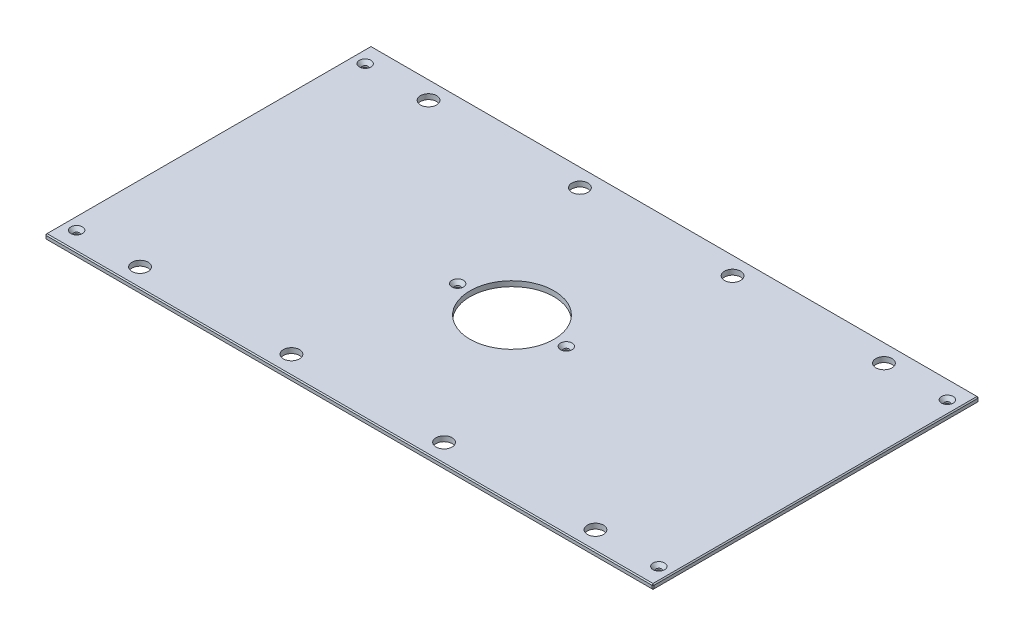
ISO-10303-21;
HEADER;
FILE_DESCRIPTION(('STEP AP214'),'2;1');
FILE_NAME('part.step','',(''),(''),'','','');
FILE_SCHEMA(('AUTOMOTIVE_DESIGN { 1 0 10303 214 1 1 1 1 }'));
ENDSEC;
DATA;
#1=APPLICATION_CONTEXT('core data for automotive mechanical design processes');
#2=APPLICATION_PROTOCOL_DEFINITION('international standard','automotive_design',2000,#1);
#3=PRODUCT_CONTEXT('',#1,'mechanical');
#4=PRODUCT('Part','Part','',(#3));
#5=PRODUCT_RELATED_PRODUCT_CATEGORY('part','',(#4));
#6=PRODUCT_DEFINITION_FORMATION('','',#4);
#7=PRODUCT_DEFINITION_CONTEXT('part definition',#1,'design');
#8=PRODUCT_DEFINITION('design','',#6,#7);
#9=PRODUCT_DEFINITION_SHAPE('','',#8);
#10=(LENGTH_UNIT() NAMED_UNIT(*) SI_UNIT(.MILLI.,.METRE.));
#11=(NAMED_UNIT(*) PLANE_ANGLE_UNIT() SI_UNIT($,.RADIAN.));
#12=(NAMED_UNIT(*) SI_UNIT($,.STERADIAN.) SOLID_ANGLE_UNIT());
#13=UNCERTAINTY_MEASURE_WITH_UNIT(LENGTH_MEASURE(1.E-05),#10,'distance_accuracy_value','');
#14=(GEOMETRIC_REPRESENTATION_CONTEXT(3) GLOBAL_UNCERTAINTY_ASSIGNED_CONTEXT((#13)) GLOBAL_UNIT_ASSIGNED_CONTEXT((#10,
#11,#12)) REPRESENTATION_CONTEXT('',''));
#15=CARTESIAN_POINT('',(0.,0.,0.));
#16=DIRECTION('',(0.,0.,1.));
#17=DIRECTION('',(1.,0.,0.));
#18=AXIS2_PLACEMENT_3D('',#15,#16,#17);
#19=CARTESIAN_POINT('',(-373.0625,6.35,-200.025));
#20=DIRECTION('',(1.,0.,0.));
#21=DIRECTION('',(0.,0.,-1.));
#22=AXIS2_PLACEMENT_3D('',#19,#20,#21);
#23=PLANE('',#22);
#24=DIRECTION('',(0.,0.,-1.));
#25=VECTOR('',#24,1.);
#26=CARTESIAN_POINT('',(-373.0625,5.0799999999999,-200.025));
#27=LINE('',#26,#25);
#28=CARTESIAN_POINT('',(-373.0625,5.0799999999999,198.755));
#29=VERTEX_POINT('',#28);
#30=CARTESIAN_POINT('',(-373.0625,5.0799999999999,-198.755));
#31=VERTEX_POINT('',#30);
#32=EDGE_CURVE('E140',#29,#31,#27,.T.);
#33=ORIENTED_EDGE('',*,*,#32,.T.);
#34=DIRECTION('',(0.,-1.,0.));
#35=VECTOR('',#34,1.);
#36=CARTESIAN_POINT('',(-373.0625,6.35,-198.755));
#37=LINE('',#36,#35);
#38=CARTESIAN_POINT('',(-373.0625,1.2700000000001,-198.755));
#39=VERTEX_POINT('',#38);
#40=EDGE_CURVE('E135',#31,#39,#37,.T.);
#41=ORIENTED_EDGE('',*,*,#40,.T.);
#42=DIRECTION('',(0.,0.,1.));
#43=VECTOR('',#42,1.);
#44=CARTESIAN_POINT('',(-373.0625,1.2700000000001,-200.025));
#45=LINE('',#44,#43);
#46=CARTESIAN_POINT('',(-373.0625,1.2700000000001,198.755));
#47=VERTEX_POINT('',#46);
#48=EDGE_CURVE('E130',#39,#47,#45,.T.);
#49=ORIENTED_EDGE('',*,*,#48,.T.);
#50=DIRECTION('',(0.,1.,0.));
#51=VECTOR('',#50,1.);
#52=CARTESIAN_POINT('',(-373.0625,6.35,198.755));
#53=LINE('',#52,#51);
#54=EDGE_CURVE('E132',#47,#29,#53,.T.);
#55=ORIENTED_EDGE('',*,*,#54,.T.);
#56=EDGE_LOOP('',(#33,#41,#49,#55));
#57=FACE_BOUND('',#56,.T.);
#58=ADVANCED_FACE('F38',(#57),#23,.F.);
#59=CARTESIAN_POINT('',(-373.0625,6.35,200.025));
#60=DIRECTION('',(0.,0.,-1.));
#61=DIRECTION('',(-1.,0.,0.));
#62=AXIS2_PLACEMENT_3D('',#59,#60,#61);
#63=PLANE('',#62);
#64=DIRECTION('',(1.,0.,0.));
#65=VECTOR('',#64,1.);
#66=CARTESIAN_POINT('',(-373.0625,1.26999999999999,200.025));
#67=LINE('',#66,#65);
#68=CARTESIAN_POINT('',(-371.7925,1.26999999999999,200.025));
#69=VERTEX_POINT('',#68);
#70=CARTESIAN_POINT('',(371.7925,1.26999999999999,200.025));
#71=VERTEX_POINT('',#70);
#72=EDGE_CURVE('E62',#69,#71,#67,.T.);
#73=ORIENTED_EDGE('',*,*,#72,.T.);
#74=DIRECTION('',(0.,1.,0.));
#75=VECTOR('',#74,1.);
#76=CARTESIAN_POINT('',(371.7925,6.35,200.025));
#77=LINE('',#76,#75);
#78=CARTESIAN_POINT('',(371.7925,5.08000000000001,200.025));
#79=VERTEX_POINT('',#78);
#80=EDGE_CURVE('E11',#71,#79,#77,.T.);
#81=ORIENTED_EDGE('',*,*,#80,.T.);
#82=DIRECTION('',(-1.,0.,0.));
#83=VECTOR('',#82,1.);
#84=CARTESIAN_POINT('',(-373.0625,5.08000000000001,200.025));
#85=LINE('',#84,#83);
#86=CARTESIAN_POINT('',(-371.7925,5.08000000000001,200.025));
#87=VERTEX_POINT('',#86);
#88=EDGE_CURVE('E48',#79,#87,#85,.T.);
#89=ORIENTED_EDGE('',*,*,#88,.T.);
#90=DIRECTION('',(0.,-1.,0.));
#91=VECTOR('',#90,1.);
#92=CARTESIAN_POINT('',(-371.7925,6.35,200.025));
#93=LINE('',#92,#91);
#94=EDGE_CURVE('E367',#87,#69,#93,.T.);
#95=ORIENTED_EDGE('',*,*,#94,.T.);
#96=EDGE_LOOP('',(#73,#81,#89,#95));
#97=FACE_BOUND('',#96,.T.);
#98=ADVANCED_FACE('F446',(#97),#63,.F.);
#99=CARTESIAN_POINT('',(373.0625,6.35,-200.025));
#100=DIRECTION('',(-1.,0.,0.));
#101=DIRECTION('',(0.,0.,1.));
#102=AXIS2_PLACEMENT_3D('',#99,#100,#101);
#103=PLANE('',#102);
#104=DIRECTION('',(0.,0.,-1.));
#105=VECTOR('',#104,1.);
#106=CARTESIAN_POINT('',(373.0625,1.26999999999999,-200.025));
#107=LINE('',#106,#105);
#108=CARTESIAN_POINT('',(373.0625,1.26999999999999,198.755));
#109=VERTEX_POINT('',#108);
#110=CARTESIAN_POINT('',(373.0625,1.26999999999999,-198.755));
#111=VERTEX_POINT('',#110);
#112=EDGE_CURVE('E360',#109,#111,#107,.T.);
#113=ORIENTED_EDGE('',*,*,#112,.T.);
#114=DIRECTION('',(0.,1.,0.));
#115=VECTOR('',#114,1.);
#116=CARTESIAN_POINT('',(373.0625,6.35,-198.755));
#117=LINE('',#116,#115);
#118=CARTESIAN_POINT('',(373.0625,5.0799999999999,-198.755));
#119=VERTEX_POINT('',#118);
#120=EDGE_CURVE('E363',#111,#119,#117,.T.);
#121=ORIENTED_EDGE('',*,*,#120,.T.);
#122=DIRECTION('',(0.,0.,1.));
#123=VECTOR('',#122,1.);
#124=CARTESIAN_POINT('',(373.0625,5.0799999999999,200.025));
#125=LINE('',#124,#123);
#126=CARTESIAN_POINT('',(373.0625,5.0799999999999,198.755));
#127=VERTEX_POINT('',#126);
#128=EDGE_CURVE('E357',#119,#127,#125,.T.);
#129=ORIENTED_EDGE('',*,*,#128,.T.);
#130=DIRECTION('',(0.,-1.,0.));
#131=VECTOR('',#130,1.);
#132=CARTESIAN_POINT('',(373.0625,6.35,198.755));
#133=LINE('',#132,#131);
#134=EDGE_CURVE('E354',#127,#109,#133,.T.);
#135=ORIENTED_EDGE('',*,*,#134,.T.);
#136=EDGE_LOOP('',(#113,#121,#129,#135));
#137=FACE_BOUND('',#136,.T.);
#138=ADVANCED_FACE('F433',(#137),#103,.F.);
#139=CARTESIAN_POINT('',(-373.0625,6.35,-200.025));
#140=DIRECTION('',(0.,0.,1.));
#141=DIRECTION('',(1.,0.,0.));
#142=AXIS2_PLACEMENT_3D('',#139,#140,#141);
#143=PLANE('',#142);
#144=DIRECTION('',(-1.,0.,0.));
#145=VECTOR('',#144,1.);
#146=CARTESIAN_POINT('',(-373.0625,1.26999999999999,-200.025));
#147=LINE('',#146,#145);
#148=CARTESIAN_POINT('',(371.7925,1.26999999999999,-200.025));
#149=VERTEX_POINT('',#148);
#150=CARTESIAN_POINT('',(-371.7925,1.26999999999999,-200.025));
#151=VERTEX_POINT('',#150);
#152=EDGE_CURVE('E319',#149,#151,#147,.T.);
#153=ORIENTED_EDGE('',*,*,#152,.T.);
#154=DIRECTION('',(0.,1.,0.));
#155=VECTOR('',#154,1.);
#156=CARTESIAN_POINT('',(-371.7925,6.35,-200.025));
#157=LINE('',#156,#155);
#158=CARTESIAN_POINT('',(-371.7925,5.0799999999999,-200.025));
#159=VERTEX_POINT('',#158);
#160=EDGE_CURVE('E325',#151,#159,#157,.T.);
#161=ORIENTED_EDGE('',*,*,#160,.T.);
#162=DIRECTION('',(1.,0.,0.));
#163=VECTOR('',#162,1.);
#164=CARTESIAN_POINT('',(373.0625,5.0799999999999,-200.025));
#165=LINE('',#164,#163);
#166=CARTESIAN_POINT('',(371.7925,5.0799999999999,-200.025));
#167=VERTEX_POINT('',#166);
#168=EDGE_CURVE('E322',#159,#167,#165,.T.);
#169=ORIENTED_EDGE('',*,*,#168,.T.);
#170=DIRECTION('',(0.,-1.,0.));
#171=VECTOR('',#170,1.);
#172=CARTESIAN_POINT('',(371.7925,6.35,-200.025));
#173=LINE('',#172,#171);
#174=EDGE_CURVE('E316',#167,#149,#173,.T.);
#175=ORIENTED_EDGE('',*,*,#174,.T.);
#176=EDGE_LOOP('',(#153,#161,#169,#175));
#177=FACE_BOUND('',#176,.T.);
#178=ADVANCED_FACE('F407',(#177),#143,.F.);
#179=CARTESIAN_POINT('',(0.,6.35,0.));
#180=DIRECTION('',(0.,1.,0.));
#181=DIRECTION('',(0.,0.,1.));
#182=AXIS2_PLACEMENT_3D('',#179,#180,#181);
#183=PLANE('',#182);
#184=CARTESIAN_POINT('',(357.1875,6.35,-177.00498));
#185=DIRECTION('',(0.,1.,0.));
#186=DIRECTION('',(0.,0.,1.));
#187=AXIS2_PLACEMENT_3D('',#184,#185,#186);
#188=CIRCLE('',#187,7.13740000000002);
#189=CARTESIAN_POINT('',(357.1875,6.35,-169.86758));
#190=VERTEX_POINT('',#189);
#191=EDGE_CURVE('E978',#190,#190,#188,.T.);
#192=ORIENTED_EDGE('',*,*,#191,.F.);
#193=EDGE_LOOP('',(#192));
#194=FACE_BOUND('',#193,.T.);
#195=CARTESIAN_POINT('',(357.1875,6.35,177.00498));
#196=DIRECTION('',(0.,1.,0.));
#197=DIRECTION('',(0.,0.,1.));
#198=AXIS2_PLACEMENT_3D('',#195,#196,#197);
#199=CIRCLE('',#198,7.13740000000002);
#200=CARTESIAN_POINT('',(357.1875,6.35,184.14238));
#201=VERTEX_POINT('',#200);
#202=EDGE_CURVE('E982',#201,#201,#199,.T.);
#203=ORIENTED_EDGE('',*,*,#202,.F.);
#204=EDGE_LOOP('',(#203));
#205=FACE_BOUND('',#204,.T.);
#206=CARTESIAN_POINT('',(-357.1875,6.35,177.00498));
#207=DIRECTION('',(0.,1.,0.));
#208=DIRECTION('',(0.,0.,1.));
#209=AXIS2_PLACEMENT_3D('',#206,#207,#208);
#210=CIRCLE('',#209,7.13740000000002);
#211=CARTESIAN_POINT('',(-357.1875,6.35,184.14238));
#212=VERTEX_POINT('',#211);
#213=EDGE_CURVE('E986',#212,#212,#210,.T.);
#214=ORIENTED_EDGE('',*,*,#213,.F.);
#215=EDGE_LOOP('',(#214));
#216=FACE_BOUND('',#215,.T.);
#217=CARTESIAN_POINT('',(-66.675,6.35,0.));
#218=DIRECTION('',(0.,1.,0.));
#219=DIRECTION('',(0.,0.,1.));
#220=AXIS2_PLACEMENT_3D('',#217,#218,#219);
#221=CIRCLE('',#220,7.1374);
#222=CARTESIAN_POINT('',(-66.675,6.35,7.1374));
#223=VERTEX_POINT('',#222);
#224=EDGE_CURVE('E990',#223,#223,#221,.T.);
#225=ORIENTED_EDGE('',*,*,#224,.F.);
#226=EDGE_LOOP('',(#225));
#227=FACE_BOUND('',#226,.T.);
#228=CARTESIAN_POINT('',(66.675,6.35,0.));
#229=DIRECTION('',(0.,1.,0.));
#230=DIRECTION('',(0.,0.,1.));
#231=AXIS2_PLACEMENT_3D('',#228,#229,#230);
#232=CIRCLE('',#231,7.1374);
#233=CARTESIAN_POINT('',(66.675,6.35,7.1374));
#234=VERTEX_POINT('',#233);
#235=EDGE_CURVE('E994',#234,#234,#232,.T.);
#236=ORIENTED_EDGE('',*,*,#235,.F.);
#237=EDGE_LOOP('',(#236));
#238=FACE_BOUND('',#237,.T.);
#239=CARTESIAN_POINT('',(-357.1875,6.35,-177.00498));
#240=DIRECTION('',(0.,1.,0.));
#241=DIRECTION('',(0.,0.,1.));
#242=AXIS2_PLACEMENT_3D('',#239,#240,#241);
#243=CIRCLE('',#242,7.13740000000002);
#244=CARTESIAN_POINT('',(-357.1875,6.35,-169.86758));
#245=VERTEX_POINT('',#244);
#246=EDGE_CURVE('E997',#245,#245,#243,.T.);
#247=ORIENTED_EDGE('',*,*,#246,.F.);
#248=EDGE_LOOP('',(#247));
#249=FACE_BOUND('',#248,.T.);
#250=DIRECTION('',(0.,0.,-1.));
#251=VECTOR('',#250,1.);
#252=CARTESIAN_POINT('',(371.7925,6.35,-200.025));
#253=LINE('',#252,#251);
#254=CARTESIAN_POINT('',(371.7925,6.35,198.755));
#255=VERTEX_POINT('',#254);
#256=CARTESIAN_POINT('',(371.7925,6.35,-198.755));
#257=VERTEX_POINT('',#256);
#258=EDGE_CURVE('E335',#255,#257,#253,.T.);
#259=ORIENTED_EDGE('',*,*,#258,.T.);
#260=DIRECTION('',(-1.,0.,0.));
#261=VECTOR('',#260,1.);
#262=CARTESIAN_POINT('',(-373.0625,6.35,-198.755));
#263=LINE('',#262,#261);
#264=CARTESIAN_POINT('',(-371.7925,6.35,-198.755));
#265=VERTEX_POINT('',#264);
#266=EDGE_CURVE('E338',#257,#265,#263,.T.);
#267=ORIENTED_EDGE('',*,*,#266,.T.);
#268=DIRECTION('',(0.,0.,1.));
#269=VECTOR('',#268,1.);
#270=CARTESIAN_POINT('',(-371.7925,6.35,200.025));
#271=LINE('',#270,#269);
#272=CARTESIAN_POINT('',(-371.7925,6.35,198.755));
#273=VERTEX_POINT('',#272);
#274=EDGE_CURVE('E332',#265,#273,#271,.T.);
#275=ORIENTED_EDGE('',*,*,#274,.T.);
#276=DIRECTION('',(1.,0.,0.));
#277=VECTOR('',#276,1.);
#278=CARTESIAN_POINT('',(373.0625,6.35,198.755));
#279=LINE('',#278,#277);
#280=EDGE_CURVE('E329',#273,#255,#279,.T.);
#281=ORIENTED_EDGE('',*,*,#280,.T.);
#282=EDGE_LOOP('',(#259,#267,#275,#281));
#283=FACE_BOUND('',#282,.T.);
#284=CARTESIAN_POINT('',(279.4,6.35,-177.00498));
#285=DIRECTION('',(0.,1.,0.));
#286=DIRECTION('',(0.,0.,1.));
#287=AXIS2_PLACEMENT_3D('',#284,#285,#286);
#288=CIRCLE('',#287,9.92187500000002);
#289=CARTESIAN_POINT('',(279.4,6.35,-167.083105));
#290=VERTEX_POINT('',#289);
#291=EDGE_CURVE('E231',#290,#290,#288,.T.);
#292=ORIENTED_EDGE('',*,*,#291,.F.);
#293=EDGE_LOOP('',(#292));
#294=FACE_BOUND('',#293,.T.);
#295=CARTESIAN_POINT('',(-279.4,6.35,-177.00498));
#296=DIRECTION('',(0.,1.,0.));
#297=DIRECTION('',(0.,0.,1.));
#298=AXIS2_PLACEMENT_3D('',#295,#296,#297);
#299=CIRCLE('',#298,9.92187500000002);
#300=CARTESIAN_POINT('',(-279.4,6.35,-167.083105));
#301=VERTEX_POINT('',#300);
#302=EDGE_CURVE('E246',#301,#301,#299,.T.);
#303=ORIENTED_EDGE('',*,*,#302,.F.);
#304=EDGE_LOOP('',(#303));
#305=FACE_BOUND('',#304,.T.);
#306=CARTESIAN_POINT('',(279.4,6.35,177.00498));
#307=DIRECTION('',(0.,1.,0.));
#308=DIRECTION('',(0.,0.,1.));
#309=AXIS2_PLACEMENT_3D('',#306,#307,#308);
#310=CIRCLE('',#309,9.92187500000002);
#311=CARTESIAN_POINT('',(279.4,6.35,186.926855));
#312=VERTEX_POINT('',#311);
#313=EDGE_CURVE('E259',#312,#312,#310,.T.);
#314=ORIENTED_EDGE('',*,*,#313,.F.);
#315=EDGE_LOOP('',(#314));
#316=FACE_BOUND('',#315,.T.);
#317=CARTESIAN_POINT('',(-279.4,6.35,177.00498));
#318=DIRECTION('',(0.,1.,0.));
#319=DIRECTION('',(0.,0.,1.));
#320=AXIS2_PLACEMENT_3D('',#317,#318,#319);
#321=CIRCLE('',#320,9.92187500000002);
#322=CARTESIAN_POINT('',(-279.4,6.35,186.926855));
#323=VERTEX_POINT('',#322);
#324=EDGE_CURVE('E267',#323,#323,#321,.T.);
#325=ORIENTED_EDGE('',*,*,#324,.F.);
#326=EDGE_LOOP('',(#325));
#327=FACE_BOUND('',#326,.T.);
#328=CARTESIAN_POINT('',(-93.6625,6.35,-177.00498));
#329=DIRECTION('',(0.,1.,0.));
#330=DIRECTION('',(0.,0.,1.));
#331=AXIS2_PLACEMENT_3D('',#328,#329,#330);
#332=CIRCLE('',#331,9.921875);
#333=CARTESIAN_POINT('',(-93.6625,6.35,-167.083105));
#334=VERTEX_POINT('',#333);
#335=EDGE_CURVE('E274',#334,#334,#332,.T.);
#336=ORIENTED_EDGE('',*,*,#335,.F.);
#337=EDGE_LOOP('',(#336));
#338=FACE_BOUND('',#337,.T.);
#339=CARTESIAN_POINT('',(93.6625,6.35,-177.00498));
#340=DIRECTION('',(0.,1.,0.));
#341=DIRECTION('',(0.,0.,1.));
#342=AXIS2_PLACEMENT_3D('',#339,#340,#341);
#343=CIRCLE('',#342,9.921875);
#344=CARTESIAN_POINT('',(93.6625,6.35,-167.083105));
#345=VERTEX_POINT('',#344);
#346=EDGE_CURVE('E281',#345,#345,#343,.T.);
#347=ORIENTED_EDGE('',*,*,#346,.F.);
#348=EDGE_LOOP('',(#347));
#349=FACE_BOUND('',#348,.T.);
#350=CARTESIAN_POINT('',(93.6625,6.35,177.00498));
#351=DIRECTION('',(0.,1.,0.));
#352=DIRECTION('',(0.,0.,1.));
#353=AXIS2_PLACEMENT_3D('',#350,#351,#352);
#354=CIRCLE('',#353,9.921875);
#355=CARTESIAN_POINT('',(93.6625,6.35,186.926855));
#356=VERTEX_POINT('',#355);
#357=EDGE_CURVE('E289',#356,#356,#354,.T.);
#358=ORIENTED_EDGE('',*,*,#357,.F.);
#359=EDGE_LOOP('',(#358));
#360=FACE_BOUND('',#359,.T.);
#361=CARTESIAN_POINT('',(-93.6625,6.35,177.00498));
#362=DIRECTION('',(0.,1.,0.));
#363=DIRECTION('',(0.,0.,1.));
#364=AXIS2_PLACEMENT_3D('',#361,#362,#363);
#365=CIRCLE('',#364,9.921875);
#366=CARTESIAN_POINT('',(-93.6625,6.35,186.926855));
#367=VERTEX_POINT('',#366);
#368=EDGE_CURVE('E297',#367,#367,#365,.T.);
#369=ORIENTED_EDGE('',*,*,#368,.F.);
#370=EDGE_LOOP('',(#369));
#371=FACE_BOUND('',#370,.T.);
#372=CARTESIAN_POINT('',(0.,6.35,0.));
#373=DIRECTION('',(0.,1.,0.));
#374=DIRECTION('',(0.,0.,1.));
#375=AXIS2_PLACEMENT_3D('',#372,#373,#374);
#376=CIRCLE('',#375,51.562);
#377=CARTESIAN_POINT('',(0.,6.35,51.562));
#378=VERTEX_POINT('',#377);
#379=EDGE_CURVE('E305',#378,#378,#376,.T.);
#380=ORIENTED_EDGE('',*,*,#379,.F.);
#381=EDGE_LOOP('',(#380));
#382=FACE_BOUND('',#381,.T.);
#383=ADVANCED_FACE('F455',(#194,#205,#216,#227,#238,#249,#283,#294,#305,#316,#327,#338,#349,
#360,#371,#382),#183,.T.);
#384=CARTESIAN_POINT('',(0.,0.,0.));
#385=DIRECTION('',(0.,1.,0.));
#386=DIRECTION('',(0.,0.,1.));
#387=AXIS2_PLACEMENT_3D('',#384,#385,#386);
#388=PLANE('',#387);
#389=CARTESIAN_POINT('',(357.1875,0.,-177.00498));
#390=DIRECTION('',(0.,1.,0.));
#391=DIRECTION('',(0.,0.,1.));
#392=AXIS2_PLACEMENT_3D('',#389,#390,#391);
#393=CIRCLE('',#392,3.3782);
#394=CARTESIAN_POINT('',(357.1875,0.,-173.62678));
#395=VERTEX_POINT('',#394);
#396=EDGE_CURVE('E1041',#395,#395,#393,.T.);
#397=ORIENTED_EDGE('',*,*,#396,.T.);
#398=EDGE_LOOP('',(#397));
#399=FACE_BOUND('',#398,.T.);
#400=CARTESIAN_POINT('',(357.1875,0.,177.00498));
#401=DIRECTION('',(0.,1.,0.));
#402=DIRECTION('',(0.,0.,1.));
#403=AXIS2_PLACEMENT_3D('',#400,#401,#402);
#404=CIRCLE('',#403,3.3782);
#405=CARTESIAN_POINT('',(357.1875,0.,180.38318));
#406=VERTEX_POINT('',#405);
#407=EDGE_CURVE('E1032',#406,#406,#404,.T.);
#408=ORIENTED_EDGE('',*,*,#407,.T.);
#409=EDGE_LOOP('',(#408));
#410=FACE_BOUND('',#409,.T.);
#411=CARTESIAN_POINT('',(-357.1875,0.,177.00498));
#412=DIRECTION('',(0.,1.,0.));
#413=DIRECTION('',(0.,0.,1.));
#414=AXIS2_PLACEMENT_3D('',#411,#412,#413);
#415=CIRCLE('',#414,3.3782);
#416=CARTESIAN_POINT('',(-357.1875,0.,180.38318));
#417=VERTEX_POINT('',#416);
#418=EDGE_CURVE('E1022',#417,#417,#415,.T.);
#419=ORIENTED_EDGE('',*,*,#418,.T.);
#420=EDGE_LOOP('',(#419));
#421=FACE_BOUND('',#420,.T.);
#422=CARTESIAN_POINT('',(-66.675,0.,0.));
#423=DIRECTION('',(0.,1.,0.));
#424=DIRECTION('',(0.,0.,1.));
#425=AXIS2_PLACEMENT_3D('',#422,#423,#424);
#426=CIRCLE('',#425,3.3782);
#427=CARTESIAN_POINT('',(-66.675,0.,3.3782));
#428=VERTEX_POINT('',#427);
#429=EDGE_CURVE('E1014',#428,#428,#426,.T.);
#430=ORIENTED_EDGE('',*,*,#429,.T.);
#431=EDGE_LOOP('',(#430));
#432=FACE_BOUND('',#431,.T.);
#433=CARTESIAN_POINT('',(66.675,0.,0.));
#434=DIRECTION('',(0.,1.,0.));
#435=DIRECTION('',(0.,0.,1.));
#436=AXIS2_PLACEMENT_3D('',#433,#434,#435);
#437=CIRCLE('',#436,3.3782);
#438=CARTESIAN_POINT('',(66.675,0.,3.3782));
#439=VERTEX_POINT('',#438);
#440=EDGE_CURVE('E1001',#439,#439,#437,.T.);
#441=ORIENTED_EDGE('',*,*,#440,.T.);
#442=EDGE_LOOP('',(#441));
#443=FACE_BOUND('',#442,.T.);
#444=CARTESIAN_POINT('',(-357.1875,0.,-177.00498));
#445=DIRECTION('',(0.,1.,0.));
#446=DIRECTION('',(0.,0.,1.));
#447=AXIS2_PLACEMENT_3D('',#444,#445,#446);
#448=CIRCLE('',#447,3.3782);
#449=CARTESIAN_POINT('',(-357.1875,0.,-173.62678));
#450=VERTEX_POINT('',#449);
#451=EDGE_CURVE('E249',#450,#450,#448,.T.);
#452=ORIENTED_EDGE('',*,*,#451,.T.);
#453=EDGE_LOOP('',(#452));
#454=FACE_BOUND('',#453,.T.);
#455=DIRECTION('',(0.,0.,-1.));
#456=VECTOR('',#455,1.);
#457=CARTESIAN_POINT('',(-371.7925,0.,0.));
#458=LINE('',#457,#456);
#459=CARTESIAN_POINT('',(-371.7925,0.,198.755));
#460=VERTEX_POINT('',#459);
#461=CARTESIAN_POINT('',(-371.7925,0.,-198.755));
#462=VERTEX_POINT('',#461);
#463=EDGE_CURVE('E165',#460,#462,#458,.T.);
#464=ORIENTED_EDGE('',*,*,#463,.T.);
#465=DIRECTION('',(1.,0.,0.));
#466=VECTOR('',#465,1.);
#467=CARTESIAN_POINT('',(0.,0.,-198.755));
#468=LINE('',#467,#466);
#469=CARTESIAN_POINT('',(371.7925,0.,-198.755));
#470=VERTEX_POINT('',#469);
#471=EDGE_CURVE('E350',#462,#470,#468,.T.);
#472=ORIENTED_EDGE('',*,*,#471,.T.);
#473=DIRECTION('',(0.,0.,1.));
#474=VECTOR('',#473,1.);
#475=CARTESIAN_POINT('',(371.7925,0.,0.));
#476=LINE('',#475,#474);
#477=CARTESIAN_POINT('',(371.7925,0.,198.755));
#478=VERTEX_POINT('',#477);
#479=EDGE_CURVE('E347',#470,#478,#476,.T.);
#480=ORIENTED_EDGE('',*,*,#479,.T.);
#481=DIRECTION('',(-1.,0.,0.));
#482=VECTOR('',#481,1.);
#483=CARTESIAN_POINT('',(0.,0.,198.755));
#484=LINE('',#483,#482);
#485=EDGE_CURVE('E342',#478,#460,#484,.T.);
#486=ORIENTED_EDGE('',*,*,#485,.T.);
#487=EDGE_LOOP('',(#464,#472,#480,#486));
#488=FACE_BOUND('',#487,.T.);
#489=CARTESIAN_POINT('',(279.4,0.,-177.00498));
#490=DIRECTION('',(0.,1.,0.));
#491=DIRECTION('',(0.,0.,1.));
#492=AXIS2_PLACEMENT_3D('',#489,#490,#491);
#493=CIRCLE('',#492,9.92187500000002);
#494=CARTESIAN_POINT('',(279.4,0.,-167.083105));
#495=VERTEX_POINT('',#494);
#496=EDGE_CURVE('E238',#495,#495,#493,.T.);
#497=ORIENTED_EDGE('',*,*,#496,.T.);
#498=EDGE_LOOP('',(#497));
#499=FACE_BOUND('',#498,.T.);
#500=CARTESIAN_POINT('',(-279.4,0.,-177.00498));
#501=DIRECTION('',(0.,1.,0.));
#502=DIRECTION('',(0.,0.,1.));
#503=AXIS2_PLACEMENT_3D('',#500,#501,#502);
#504=CIRCLE('',#503,9.92187500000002);
#505=CARTESIAN_POINT('',(-279.4,0.,-167.083105));
#506=VERTEX_POINT('',#505);
#507=EDGE_CURVE('E255',#506,#506,#504,.T.);
#508=ORIENTED_EDGE('',*,*,#507,.T.);
#509=EDGE_LOOP('',(#508));
#510=FACE_BOUND('',#509,.T.);
#511=CARTESIAN_POINT('',(279.4,0.,177.00498));
#512=DIRECTION('',(0.,1.,0.));
#513=DIRECTION('',(0.,0.,1.));
#514=AXIS2_PLACEMENT_3D('',#511,#512,#513);
#515=CIRCLE('',#514,9.92187500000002);
#516=CARTESIAN_POINT('',(279.4,0.,186.926855));
#517=VERTEX_POINT('',#516);
#518=EDGE_CURVE('E263',#517,#517,#515,.T.);
#519=ORIENTED_EDGE('',*,*,#518,.T.);
#520=EDGE_LOOP('',(#519));
#521=FACE_BOUND('',#520,.T.);
#522=CARTESIAN_POINT('',(-279.4,0.,177.00498));
#523=DIRECTION('',(0.,1.,0.));
#524=DIRECTION('',(0.,0.,1.));
#525=AXIS2_PLACEMENT_3D('',#522,#523,#524);
#526=CIRCLE('',#525,9.92187500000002);
#527=CARTESIAN_POINT('',(-279.4,0.,186.926855));
#528=VERTEX_POINT('',#527);
#529=EDGE_CURVE('E270',#528,#528,#526,.T.);
#530=ORIENTED_EDGE('',*,*,#529,.T.);
#531=EDGE_LOOP('',(#530));
#532=FACE_BOUND('',#531,.T.);
#533=CARTESIAN_POINT('',(-93.6625,0.,-177.00498));
#534=DIRECTION('',(0.,1.,0.));
#535=DIRECTION('',(0.,0.,1.));
#536=AXIS2_PLACEMENT_3D('',#533,#534,#535);
#537=CIRCLE('',#536,9.921875);
#538=CARTESIAN_POINT('',(-93.6625,0.,-167.083105));
#539=VERTEX_POINT('',#538);
#540=EDGE_CURVE('E278',#539,#539,#537,.T.);
#541=ORIENTED_EDGE('',*,*,#540,.T.);
#542=EDGE_LOOP('',(#541));
#543=FACE_BOUND('',#542,.T.);
#544=CARTESIAN_POINT('',(93.6625,0.,-177.00498));
#545=DIRECTION('',(0.,1.,0.));
#546=DIRECTION('',(0.,0.,1.));
#547=AXIS2_PLACEMENT_3D('',#544,#545,#546);
#548=CIRCLE('',#547,9.921875);
#549=CARTESIAN_POINT('',(93.6625,0.,-167.083105));
#550=VERTEX_POINT('',#549);
#551=EDGE_CURVE('E285',#550,#550,#548,.T.);
#552=ORIENTED_EDGE('',*,*,#551,.T.);
#553=EDGE_LOOP('',(#552));
#554=FACE_BOUND('',#553,.T.);
#555=CARTESIAN_POINT('',(93.6625,0.,177.00498));
#556=DIRECTION('',(0.,1.,0.));
#557=DIRECTION('',(0.,0.,1.));
#558=AXIS2_PLACEMENT_3D('',#555,#556,#557);
#559=CIRCLE('',#558,9.921875);
#560=CARTESIAN_POINT('',(93.6625,0.,186.926855));
#561=VERTEX_POINT('',#560);
#562=EDGE_CURVE('E293',#561,#561,#559,.T.);
#563=ORIENTED_EDGE('',*,*,#562,.T.);
#564=EDGE_LOOP('',(#563));
#565=FACE_BOUND('',#564,.T.);
#566=CARTESIAN_POINT('',(-93.6625,0.,177.00498));
#567=DIRECTION('',(0.,1.,0.));
#568=DIRECTION('',(0.,0.,1.));
#569=AXIS2_PLACEMENT_3D('',#566,#567,#568);
#570=CIRCLE('',#569,9.921875);
#571=CARTESIAN_POINT('',(-93.6625,0.,186.926855));
#572=VERTEX_POINT('',#571);
#573=EDGE_CURVE('E301',#572,#572,#570,.T.);
#574=ORIENTED_EDGE('',*,*,#573,.T.);
#575=EDGE_LOOP('',(#574));
#576=FACE_BOUND('',#575,.T.);
#577=CARTESIAN_POINT('',(0.,0.,0.));
#578=DIRECTION('',(0.,1.,0.));
#579=DIRECTION('',(0.,0.,1.));
#580=AXIS2_PLACEMENT_3D('',#577,#578,#579);
#581=CIRCLE('',#580,51.562);
#582=CARTESIAN_POINT('',(0.,0.,51.562));
#583=VERTEX_POINT('',#582);
#584=EDGE_CURVE('E153',#583,#583,#581,.T.);
#585=ORIENTED_EDGE('',*,*,#584,.T.);
#586=EDGE_LOOP('',(#585));
#587=FACE_BOUND('',#586,.T.);
#588=ADVANCED_FACE('F420',(#399,#410,#421,#432,#443,#454,#488,#499,#510,#521,#532,#543,#554,
#565,#576,#587),#388,.F.);
#589=CARTESIAN_POINT('',(0.,0.,0.));
#590=DIRECTION('',(0.,1.,0.));
#591=DIRECTION('',(0.,0.,1.));
#592=AXIS2_PLACEMENT_3D('',#589,#590,#591);
#593=CYLINDRICAL_SURFACE('',#592,51.562);
#594=ORIENTED_EDGE('',*,*,#584,.F.);
#595=EDGE_LOOP('',(#594));
#596=FACE_BOUND('',#595,.T.);
#597=ORIENTED_EDGE('',*,*,#379,.T.);
#598=EDGE_LOOP('',(#597));
#599=FACE_BOUND('',#598,.T.);
#600=ADVANCED_FACE('F701',(#596,#599),#593,.F.);
#601=CARTESIAN_POINT('',(-93.6625,6.35,177.00498));
#602=DIRECTION('',(0.,1.,0.));
#603=DIRECTION('',(0.,0.,1.));
#604=AXIS2_PLACEMENT_3D('',#601,#602,#603);
#605=CYLINDRICAL_SURFACE('',#604,9.921875);
#606=ORIENTED_EDGE('',*,*,#573,.F.);
#607=EDGE_LOOP('',(#606));
#608=FACE_BOUND('',#607,.T.);
#609=ORIENTED_EDGE('',*,*,#368,.T.);
#610=EDGE_LOOP('',(#609));
#611=FACE_BOUND('',#610,.T.);
#612=ADVANCED_FACE('F895',(#608,#611),#605,.F.);
#613=CARTESIAN_POINT('',(93.6625,6.35,177.00498));
#614=DIRECTION('',(0.,1.,0.));
#615=DIRECTION('',(0.,0.,1.));
#616=AXIS2_PLACEMENT_3D('',#613,#614,#615);
#617=CYLINDRICAL_SURFACE('',#616,9.921875);
#618=ORIENTED_EDGE('',*,*,#562,.F.);
#619=EDGE_LOOP('',(#618));
#620=FACE_BOUND('',#619,.T.);
#621=ORIENTED_EDGE('',*,*,#357,.T.);
#622=EDGE_LOOP('',(#621));
#623=FACE_BOUND('',#622,.T.);
#624=ADVANCED_FACE('F885',(#620,#623),#617,.F.);
#625=CARTESIAN_POINT('',(93.6625,6.35,-177.00498));
#626=DIRECTION('',(0.,1.,0.));
#627=DIRECTION('',(0.,0.,1.));
#628=AXIS2_PLACEMENT_3D('',#625,#626,#627);
#629=CYLINDRICAL_SURFACE('',#628,9.921875);
#630=ORIENTED_EDGE('',*,*,#551,.F.);
#631=EDGE_LOOP('',(#630));
#632=FACE_BOUND('',#631,.T.);
#633=ORIENTED_EDGE('',*,*,#346,.T.);
#634=EDGE_LOOP('',(#633));
#635=FACE_BOUND('',#634,.T.);
#636=ADVANCED_FACE('F875',(#632,#635),#629,.F.);
#637=CARTESIAN_POINT('',(-93.6625,6.35,-177.00498));
#638=DIRECTION('',(0.,1.,0.));
#639=DIRECTION('',(0.,0.,1.));
#640=AXIS2_PLACEMENT_3D('',#637,#638,#639);
#641=CYLINDRICAL_SURFACE('',#640,9.921875);
#642=ORIENTED_EDGE('',*,*,#540,.F.);
#643=EDGE_LOOP('',(#642));
#644=FACE_BOUND('',#643,.T.);
#645=ORIENTED_EDGE('',*,*,#335,.T.);
#646=EDGE_LOOP('',(#645));
#647=FACE_BOUND('',#646,.T.);
#648=ADVANCED_FACE('F865',(#644,#647),#641,.F.);
#649=CARTESIAN_POINT('',(-279.4,6.35,177.00498));
#650=DIRECTION('',(0.,1.,0.));
#651=DIRECTION('',(0.,0.,1.));
#652=AXIS2_PLACEMENT_3D('',#649,#650,#651);
#653=CYLINDRICAL_SURFACE('',#652,9.92187500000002);
#654=ORIENTED_EDGE('',*,*,#529,.F.);
#655=EDGE_LOOP('',(#654));
#656=FACE_BOUND('',#655,.T.);
#657=ORIENTED_EDGE('',*,*,#324,.T.);
#658=EDGE_LOOP('',(#657));
#659=FACE_BOUND('',#658,.T.);
#660=ADVANCED_FACE('F855',(#656,#659),#653,.F.);
#661=CARTESIAN_POINT('',(279.4,6.35,177.00498));
#662=DIRECTION('',(0.,1.,0.));
#663=DIRECTION('',(0.,0.,1.));
#664=AXIS2_PLACEMENT_3D('',#661,#662,#663);
#665=CYLINDRICAL_SURFACE('',#664,9.92187500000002);
#666=ORIENTED_EDGE('',*,*,#518,.F.);
#667=EDGE_LOOP('',(#666));
#668=FACE_BOUND('',#667,.T.);
#669=ORIENTED_EDGE('',*,*,#313,.T.);
#670=EDGE_LOOP('',(#669));
#671=FACE_BOUND('',#670,.T.);
#672=ADVANCED_FACE('F845',(#668,#671),#665,.F.);
#673=CARTESIAN_POINT('',(-279.4,6.35,-177.00498));
#674=DIRECTION('',(0.,1.,0.));
#675=DIRECTION('',(0.,0.,1.));
#676=AXIS2_PLACEMENT_3D('',#673,#674,#675);
#677=CYLINDRICAL_SURFACE('',#676,9.92187500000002);
#678=ORIENTED_EDGE('',*,*,#507,.F.);
#679=EDGE_LOOP('',(#678));
#680=FACE_BOUND('',#679,.T.);
#681=ORIENTED_EDGE('',*,*,#302,.T.);
#682=EDGE_LOOP('',(#681));
#683=FACE_BOUND('',#682,.T.);
#684=ADVANCED_FACE('F835',(#680,#683),#677,.F.);
#685=CARTESIAN_POINT('',(279.4,6.35,-177.00498));
#686=DIRECTION('',(0.,1.,0.));
#687=DIRECTION('',(0.,0.,1.));
#688=AXIS2_PLACEMENT_3D('',#685,#686,#687);
#689=CYLINDRICAL_SURFACE('',#688,9.92187500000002);
#690=ORIENTED_EDGE('',*,*,#496,.F.);
#691=EDGE_LOOP('',(#690));
#692=FACE_BOUND('',#691,.T.);
#693=ORIENTED_EDGE('',*,*,#291,.T.);
#694=EDGE_LOOP('',(#693));
#695=FACE_BOUND('',#694,.T.);
#696=ADVANCED_FACE('F464',(#692,#695),#689,.F.);
#697=CARTESIAN_POINT('',(373.0625,6.35,198.755));
#698=DIRECTION('',(-0.707106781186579,0.,-0.707106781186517));
#699=DIRECTION('',(0.,-1.,0.));
#700=AXIS2_PLACEMENT_3D('',#697,#698,#699);
#701=PLANE('',#700);
#702=DIRECTION('',(-0.707106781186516,0.,0.707106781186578));
#703=VECTOR('',#702,1.);
#704=CARTESIAN_POINT('',(373.0625,5.0799999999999,198.755));
#705=LINE('',#704,#703);
#706=EDGE_CURVE('E42',#79,#127,#705,.F.);
#707=ORIENTED_EDGE('',*,*,#706,.F.);
#708=ORIENTED_EDGE('',*,*,#80,.F.);
#709=DIRECTION('',(0.707106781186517,0.,-0.707106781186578));
#710=VECTOR('',#709,1.);
#711=CARTESIAN_POINT('',(372.4275,1.26999999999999,199.39));
#712=LINE('',#711,#710);
#713=EDGE_CURVE('E220',#109,#71,#712,.F.);
#714=ORIENTED_EDGE('',*,*,#713,.F.);
#715=ORIENTED_EDGE('',*,*,#134,.F.);
#716=EDGE_LOOP('',(#707,#708,#714,#715));
#717=FACE_BOUND('',#716,.T.);
#718=ADVANCED_FACE('F40',(#717),#701,.F.);
#719=CARTESIAN_POINT('',(373.0625,5.0799999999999,198.755));
#720=DIRECTION('',(0.577350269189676,0.577350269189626,0.577350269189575));
#721=DIRECTION('',(-0.707106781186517,0.707106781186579,0.));
#722=AXIS2_PLACEMENT_3D('',#719,#720,#721);
#723=PLANE('',#722);
#724=DIRECTION('',(0.,-0.707106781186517,0.707106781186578));
#725=VECTOR('',#724,1.);
#726=CARTESIAN_POINT('',(371.7925,5.715,199.39));
#727=LINE('',#726,#725);
#728=EDGE_CURVE('E214',#79,#255,#727,.F.);
#729=ORIENTED_EDGE('',*,*,#728,.F.);
#730=ORIENTED_EDGE('',*,*,#706,.T.);
#731=DIRECTION('',(-0.707106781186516,0.707106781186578,0.));
#732=VECTOR('',#731,1.);
#733=CARTESIAN_POINT('',(373.0625,5.0799999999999,198.755));
#734=LINE('',#733,#732);
#735=EDGE_CURVE('E217',#255,#127,#734,.F.);
#736=ORIENTED_EDGE('',*,*,#735,.F.);
#737=EDGE_LOOP('',(#729,#730,#736));
#738=FACE_BOUND('',#737,.T.);
#739=ADVANCED_FACE('F457',(#738),#723,.T.);
#740=CARTESIAN_POINT('',(371.7925,0.,198.755));
#741=DIRECTION('',(0.577350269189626,-0.577350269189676,0.577350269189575));
#742=DIRECTION('',(0.707106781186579,0.707106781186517,0.));
#743=AXIS2_PLACEMENT_3D('',#740,#741,#742);
#744=PLANE('',#743);
#745=DIRECTION('',(-0.707106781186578,-0.707106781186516,0.));
#746=VECTOR('',#745,1.);
#747=CARTESIAN_POINT('',(371.7925,0.,198.755));
#748=LINE('',#747,#746);
#749=EDGE_CURVE('E206',#109,#478,#748,.T.);
#750=ORIENTED_EDGE('',*,*,#749,.F.);
#751=ORIENTED_EDGE('',*,*,#713,.T.);
#752=DIRECTION('',(0.,0.707106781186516,0.707106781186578));
#753=VECTOR('',#752,1.);
#754=CARTESIAN_POINT('',(371.7925,0.,198.755));
#755=LINE('',#754,#753);
#756=EDGE_CURVE('E210',#478,#71,#755,.T.);
#757=ORIENTED_EDGE('',*,*,#756,.F.);
#758=EDGE_LOOP('',(#750,#751,#757));
#759=FACE_BOUND('',#758,.T.);
#760=ADVANCED_FACE('F426',(#759),#744,.T.);
#761=CARTESIAN_POINT('',(371.7925,6.35,0.));
#762=DIRECTION('',(0.707106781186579,0.707106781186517,0.));
#763=DIRECTION('',(0.,0.,1.));
#764=AXIS2_PLACEMENT_3D('',#761,#762,#763);
#765=PLANE('',#764);
#766=ORIENTED_EDGE('',*,*,#735,.T.);
#767=ORIENTED_EDGE('',*,*,#128,.F.);
#768=DIRECTION('',(0.707106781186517,-0.707106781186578,0.));
#769=VECTOR('',#768,1.);
#770=CARTESIAN_POINT('',(372.4275,5.71499999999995,-198.755));
#771=LINE('',#770,#769);
#772=EDGE_CURVE('E200',#257,#119,#771,.T.);
#773=ORIENTED_EDGE('',*,*,#772,.F.);
#774=ORIENTED_EDGE('',*,*,#258,.F.);
#775=EDGE_LOOP('',(#766,#767,#773,#774));
#776=FACE_BOUND('',#775,.T.);
#777=ADVANCED_FACE('F443',(#776),#765,.T.);
#778=CARTESIAN_POINT('',(0.,6.35,198.755));
#779=DIRECTION('',(0.,0.707106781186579,0.707106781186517));
#780=DIRECTION('',(-1.,0.,0.));
#781=AXIS2_PLACEMENT_3D('',#778,#779,#780);
#782=PLANE('',#781);
#783=ORIENTED_EDGE('',*,*,#728,.T.);
#784=ORIENTED_EDGE('',*,*,#280,.F.);
#785=DIRECTION('',(0.,0.707106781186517,-0.707106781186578));
#786=VECTOR('',#785,1.);
#787=CARTESIAN_POINT('',(-371.7925,6.35,198.755));
#788=LINE('',#787,#786);
#789=EDGE_CURVE('E196',#87,#273,#788,.T.);
#790=ORIENTED_EDGE('',*,*,#789,.F.);
#791=ORIENTED_EDGE('',*,*,#88,.F.);
#792=EDGE_LOOP('',(#783,#784,#790,#791));
#793=FACE_BOUND('',#792,.T.);
#794=ADVANCED_FACE('F448',(#793),#782,.T.);
#795=CARTESIAN_POINT('',(-371.7925,6.35,200.025));
#796=DIRECTION('',(0.707106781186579,0.,-0.707106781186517));
#797=DIRECTION('',(0.,-1.,0.));
#798=AXIS2_PLACEMENT_3D('',#795,#796,#797);
#799=PLANE('',#798);
#800=DIRECTION('',(0.707106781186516,0.,0.707106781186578));
#801=VECTOR('',#800,1.);
#802=CARTESIAN_POINT('',(-373.0625,1.2700000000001,198.755));
#803=LINE('',#802,#801);
#804=EDGE_CURVE('E147',#69,#47,#803,.F.);
#805=ORIENTED_EDGE('',*,*,#804,.F.);
#806=ORIENTED_EDGE('',*,*,#94,.F.);
#807=DIRECTION('',(-0.707106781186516,0.,-0.707106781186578));
#808=VECTOR('',#807,1.);
#809=CARTESIAN_POINT('',(-372.4275,5.07999999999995,199.39));
#810=LINE('',#809,#808);
#811=EDGE_CURVE('E150',#29,#87,#810,.F.);
#812=ORIENTED_EDGE('',*,*,#811,.F.);
#813=ORIENTED_EDGE('',*,*,#54,.F.);
#814=EDGE_LOOP('',(#805,#806,#812,#813));
#815=FACE_BOUND('',#814,.T.);
#816=ADVANCED_FACE('F145',(#815),#799,.F.);
#817=CARTESIAN_POINT('',(-373.0625,1.26999999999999,200.025));
#818=DIRECTION('',(0.,0.707106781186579,-0.707106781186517));
#819=DIRECTION('',(1.,0.,0.));
#820=AXIS2_PLACEMENT_3D('',#817,#818,#819);
#821=PLANE('',#820);
#822=ORIENTED_EDGE('',*,*,#756,.T.);
#823=ORIENTED_EDGE('',*,*,#72,.F.);
#824=DIRECTION('',(0.,-0.707106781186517,-0.707106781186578));
#825=VECTOR('',#824,1.);
#826=CARTESIAN_POINT('',(-371.7925,0.634999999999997,199.39));
#827=LINE('',#826,#825);
#828=EDGE_CURVE('E161',#460,#69,#827,.F.);
#829=ORIENTED_EDGE('',*,*,#828,.F.);
#830=ORIENTED_EDGE('',*,*,#485,.F.);
#831=EDGE_LOOP('',(#822,#823,#829,#830));
#832=FACE_BOUND('',#831,.T.);
#833=ADVANCED_FACE('F425',(#832),#821,.F.);
#834=CARTESIAN_POINT('',(373.0625,1.26999999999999,-200.025));
#835=DIRECTION('',(-0.707106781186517,0.707106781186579,0.));
#836=DIRECTION('',(0.,0.,-1.));
#837=AXIS2_PLACEMENT_3D('',#834,#835,#836);
#838=PLANE('',#837);
#839=ORIENTED_EDGE('',*,*,#749,.T.);
#840=ORIENTED_EDGE('',*,*,#479,.F.);
#841=DIRECTION('',(0.707106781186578,0.707106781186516,0.));
#842=VECTOR('',#841,1.);
#843=CARTESIAN_POINT('',(371.7925,0.,-198.755));
#844=LINE('',#843,#842);
#845=EDGE_CURVE('E188',#111,#470,#844,.F.);
#846=ORIENTED_EDGE('',*,*,#845,.F.);
#847=ORIENTED_EDGE('',*,*,#112,.F.);
#848=EDGE_LOOP('',(#839,#840,#846,#847));
#849=FACE_BOUND('',#848,.T.);
#850=ADVANCED_FACE('F430',(#849),#838,.F.);
#851=CARTESIAN_POINT('',(371.7925,6.35,-200.025));
#852=DIRECTION('',(-0.707106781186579,0.,0.707106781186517));
#853=DIRECTION('',(0.,-1.,0.));
#854=AXIS2_PLACEMENT_3D('',#851,#852,#853);
#855=PLANE('',#854);
#856=DIRECTION('',(0.707106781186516,0.,0.707106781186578));
#857=VECTOR('',#856,1.);
#858=CARTESIAN_POINT('',(371.7925,5.0799999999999,-200.025));
#859=LINE('',#858,#857);
#860=EDGE_CURVE('E202',#119,#167,#859,.F.);
#861=ORIENTED_EDGE('',*,*,#860,.F.);
#862=ORIENTED_EDGE('',*,*,#120,.F.);
#863=DIRECTION('',(-0.707106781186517,0.,-0.707106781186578));
#864=VECTOR('',#863,1.);
#865=CARTESIAN_POINT('',(372.4275,1.26999999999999,-199.39));
#866=LINE('',#865,#864);
#867=EDGE_CURVE('E184',#149,#111,#866,.F.);
#868=ORIENTED_EDGE('',*,*,#867,.F.);
#869=ORIENTED_EDGE('',*,*,#174,.F.);
#870=EDGE_LOOP('',(#861,#862,#868,#869));
#871=FACE_BOUND('',#870,.T.);
#872=ADVANCED_FACE('F438',(#871),#855,.F.);
#873=CARTESIAN_POINT('',(371.7925,5.0799999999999,-200.025));
#874=DIRECTION('',(0.577350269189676,0.577350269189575,-0.577350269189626));
#875=DIRECTION('',(-0.707106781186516,0.,-0.707106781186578));
#876=AXIS2_PLACEMENT_3D('',#873,#874,#875);
#877=PLANE('',#876);
#878=ORIENTED_EDGE('',*,*,#772,.T.);
#879=ORIENTED_EDGE('',*,*,#860,.T.);
#880=DIRECTION('',(0.,0.707106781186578,0.707106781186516));
#881=VECTOR('',#880,1.);
#882=CARTESIAN_POINT('',(371.7925,5.0799999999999,-200.025));
#883=LINE('',#882,#881);
#884=EDGE_CURVE('E174',#257,#167,#883,.F.);
#885=ORIENTED_EDGE('',*,*,#884,.F.);
#886=EDGE_LOOP('',(#878,#879,#885));
#887=FACE_BOUND('',#886,.T.);
#888=ADVANCED_FACE('F496',(#887),#877,.T.);
#889=CARTESIAN_POINT('',(-371.7925,6.35,198.755));
#890=DIRECTION('',(-0.577350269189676,0.577350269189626,0.577350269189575));
#891=DIRECTION('',(-0.707106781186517,-0.707106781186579,0.));
#892=AXIS2_PLACEMENT_3D('',#889,#890,#891);
#893=PLANE('',#892);
#894=ORIENTED_EDGE('',*,*,#811,.T.);
#895=ORIENTED_EDGE('',*,*,#789,.T.);
#896=DIRECTION('',(-0.707106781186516,-0.707106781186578,0.));
#897=VECTOR('',#896,1.);
#898=CARTESIAN_POINT('',(-371.7925,6.35,198.755));
#899=LINE('',#898,#897);
#900=EDGE_CURVE('E167',#29,#273,#899,.F.);
#901=ORIENTED_EDGE('',*,*,#900,.F.);
#902=EDGE_LOOP('',(#894,#895,#901));
#903=FACE_BOUND('',#902,.T.);
#904=ADVANCED_FACE('F450',(#903),#893,.T.);
#905=CARTESIAN_POINT('',(-373.0625,1.2700000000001,198.755));
#906=DIRECTION('',(-0.577350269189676,-0.577350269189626,0.577350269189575));
#907=DIRECTION('',(0.707106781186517,-0.707106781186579,0.));
#908=AXIS2_PLACEMENT_3D('',#905,#906,#907);
#909=PLANE('',#908);
#910=ORIENTED_EDGE('',*,*,#828,.T.);
#911=ORIENTED_EDGE('',*,*,#804,.T.);
#912=DIRECTION('',(-0.707106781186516,0.707106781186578,0.));
#913=VECTOR('',#912,1.);
#914=CARTESIAN_POINT('',(-373.0625,1.2700000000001,198.755));
#915=LINE('',#914,#913);
#916=EDGE_CURVE('E158',#460,#47,#915,.T.);
#917=ORIENTED_EDGE('',*,*,#916,.F.);
#918=EDGE_LOOP('',(#910,#911,#917));
#919=FACE_BOUND('',#918,.T.);
#920=ADVANCED_FACE('F157',(#919),#909,.T.);
#921=CARTESIAN_POINT('',(371.7925,0.,-198.755));
#922=DIRECTION('',(0.577350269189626,-0.577350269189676,-0.577350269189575));
#923=DIRECTION('',(0.707106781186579,0.707106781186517,0.));
#924=AXIS2_PLACEMENT_3D('',#921,#922,#923);
#925=PLANE('',#924);
#926=ORIENTED_EDGE('',*,*,#867,.T.);
#927=ORIENTED_EDGE('',*,*,#845,.T.);
#928=DIRECTION('',(0.,-0.707106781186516,0.707106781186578));
#929=VECTOR('',#928,1.);
#930=CARTESIAN_POINT('',(371.7925,0.,-198.755));
#931=LINE('',#930,#929);
#932=EDGE_CURVE('E168',#149,#470,#931,.T.);
#933=ORIENTED_EDGE('',*,*,#932,.F.);
#934=EDGE_LOOP('',(#926,#927,#933));
#935=FACE_BOUND('',#934,.T.);
#936=ADVANCED_FACE('F488',(#935),#925,.T.);
#937=CARTESIAN_POINT('',(0.,6.35,-198.755));
#938=DIRECTION('',(0.,0.707106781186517,-0.707106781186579));
#939=DIRECTION('',(1.,0.,0.));
#940=AXIS2_PLACEMENT_3D('',#937,#938,#939);
#941=PLANE('',#940);
#942=ORIENTED_EDGE('',*,*,#884,.T.);
#943=ORIENTED_EDGE('',*,*,#168,.F.);
#944=DIRECTION('',(0.,-0.707106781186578,-0.707106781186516));
#945=VECTOR('',#944,1.);
#946=CARTESIAN_POINT('',(-371.7925,5.0799999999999,-200.025));
#947=LINE('',#946,#945);
#948=EDGE_CURVE('E177',#265,#159,#947,.T.);
#949=ORIENTED_EDGE('',*,*,#948,.F.);
#950=ORIENTED_EDGE('',*,*,#266,.F.);
#951=EDGE_LOOP('',(#942,#943,#949,#950));
#952=FACE_BOUND('',#951,.T.);
#953=ADVANCED_FACE('F402',(#952),#941,.T.);
#954=CARTESIAN_POINT('',(-371.7925,6.35,0.));
#955=DIRECTION('',(-0.707106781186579,0.707106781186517,0.));
#956=DIRECTION('',(0.,0.,-1.));
#957=AXIS2_PLACEMENT_3D('',#954,#955,#956);
#958=PLANE('',#957);
#959=ORIENTED_EDGE('',*,*,#900,.T.);
#960=ORIENTED_EDGE('',*,*,#274,.F.);
#961=DIRECTION('',(0.707106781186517,0.707106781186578,0.));
#962=VECTOR('',#961,1.);
#963=CARTESIAN_POINT('',(-372.4275,5.71499999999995,-198.755));
#964=LINE('',#963,#962);
#965=EDGE_CURVE('E388',#31,#265,#964,.T.);
#966=ORIENTED_EDGE('',*,*,#965,.F.);
#967=ORIENTED_EDGE('',*,*,#32,.F.);
#968=EDGE_LOOP('',(#959,#960,#966,#967));
#969=FACE_BOUND('',#968,.T.);
#970=ADVANCED_FACE('F453',(#969),#958,.T.);
#971=CARTESIAN_POINT('',(-373.0625,1.2700000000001,-200.025));
#972=DIRECTION('',(0.707106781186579,0.707106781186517,0.));
#973=DIRECTION('',(0.,0.,1.));
#974=AXIS2_PLACEMENT_3D('',#971,#972,#973);
#975=PLANE('',#974);
#976=ORIENTED_EDGE('',*,*,#916,.T.);
#977=ORIENTED_EDGE('',*,*,#48,.F.);
#978=DIRECTION('',(0.707106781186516,-0.707106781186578,0.));
#979=VECTOR('',#978,1.);
#980=CARTESIAN_POINT('',(-373.0625,1.2700000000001,-198.755));
#981=LINE('',#980,#979);
#982=EDGE_CURVE('E384',#462,#39,#981,.F.);
#983=ORIENTED_EDGE('',*,*,#982,.F.);
#984=ORIENTED_EDGE('',*,*,#463,.F.);
#985=EDGE_LOOP('',(#976,#977,#983,#984));
#986=FACE_BOUND('',#985,.T.);
#987=ADVANCED_FACE('F164',(#986),#975,.F.);
#988=CARTESIAN_POINT('',(-373.0625,1.26999999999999,-200.025));
#989=DIRECTION('',(0.,0.707106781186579,0.707106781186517));
#990=DIRECTION('',(-1.,0.,0.));
#991=AXIS2_PLACEMENT_3D('',#988,#989,#990);
#992=PLANE('',#991);
#993=ORIENTED_EDGE('',*,*,#932,.T.);
#994=ORIENTED_EDGE('',*,*,#471,.F.);
#995=DIRECTION('',(0.,0.707106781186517,-0.707106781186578));
#996=VECTOR('',#995,1.);
#997=CARTESIAN_POINT('',(-371.7925,0.634999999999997,-199.39));
#998=LINE('',#997,#996);
#999=EDGE_CURVE('E380',#151,#462,#998,.F.);
#1000=ORIENTED_EDGE('',*,*,#999,.F.);
#1001=ORIENTED_EDGE('',*,*,#152,.F.);
#1002=EDGE_LOOP('',(#993,#994,#1000,#1001));
#1003=FACE_BOUND('',#1002,.T.);
#1004=ADVANCED_FACE('F417',(#1003),#992,.F.);
#1005=CARTESIAN_POINT('',(-371.7925,5.0799999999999,-200.025));
#1006=DIRECTION('',(-0.577350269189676,0.577350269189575,-0.577350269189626));
#1007=DIRECTION('',(-0.707106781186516,0.,0.707106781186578));
#1008=AXIS2_PLACEMENT_3D('',#1005,#1006,#1007);
#1009=PLANE('',#1008);
#1010=ORIENTED_EDGE('',*,*,#965,.T.);
#1011=ORIENTED_EDGE('',*,*,#948,.T.);
#1012=DIRECTION('',(0.707106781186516,0.,-0.707106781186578));
#1013=VECTOR('',#1012,1.);
#1014=CARTESIAN_POINT('',(-371.7925,5.0799999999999,-200.025));
#1015=LINE('',#1014,#1013);
#1016=EDGE_CURVE('E377',#31,#159,#1015,.T.);
#1017=ORIENTED_EDGE('',*,*,#1016,.F.);
#1018=EDGE_LOOP('',(#1010,#1011,#1017));
#1019=FACE_BOUND('',#1018,.T.);
#1020=ADVANCED_FACE('F397',(#1019),#1009,.T.);
#1021=CARTESIAN_POINT('',(-373.0625,1.2700000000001,-198.755));
#1022=DIRECTION('',(-0.577350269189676,-0.577350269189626,-0.577350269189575));
#1023=DIRECTION('',(0.707106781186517,-0.707106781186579,0.));
#1024=AXIS2_PLACEMENT_3D('',#1021,#1022,#1023);
#1025=PLANE('',#1024);
#1026=ORIENTED_EDGE('',*,*,#999,.T.);
#1027=ORIENTED_EDGE('',*,*,#982,.T.);
#1028=DIRECTION('',(-0.707106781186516,0.,0.707106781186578));
#1029=VECTOR('',#1028,1.);
#1030=CARTESIAN_POINT('',(-373.0625,1.2700000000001,-198.755));
#1031=LINE('',#1030,#1029);
#1032=EDGE_CURVE('E374',#151,#39,#1031,.T.);
#1033=ORIENTED_EDGE('',*,*,#1032,.F.);
#1034=EDGE_LOOP('',(#1026,#1027,#1033));
#1035=FACE_BOUND('',#1034,.T.);
#1036=ADVANCED_FACE('F414',(#1035),#1025,.T.);
#1037=CARTESIAN_POINT('',(-373.0625,6.35,-198.755));
#1038=DIRECTION('',(0.707106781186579,0.,0.707106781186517));
#1039=DIRECTION('',(0.,-1.,0.));
#1040=AXIS2_PLACEMENT_3D('',#1037,#1038,#1039);
#1041=PLANE('',#1040);
#1042=ORIENTED_EDGE('',*,*,#1016,.T.);
#1043=ORIENTED_EDGE('',*,*,#160,.F.);
#1044=ORIENTED_EDGE('',*,*,#1032,.T.);
#1045=ORIENTED_EDGE('',*,*,#40,.F.);
#1046=EDGE_LOOP('',(#1042,#1043,#1044,#1045));
#1047=FACE_BOUND('',#1046,.T.);
#1048=ADVANCED_FACE('F412',(#1047),#1041,.F.);
#1049=CARTESIAN_POINT('',(-357.1875,6.35,-177.00498));
#1050=DIRECTION('',(0.,1.,0.));
#1051=DIRECTION('',(0.,0.,1.));
#1052=AXIS2_PLACEMENT_3D('',#1049,#1050,#1051);
#1053=CYLINDRICAL_SURFACE('',#1052,3.3782);
#1054=ORIENTED_EDGE('',*,*,#451,.F.);
#1055=EDGE_LOOP('',(#1054));
#1056=FACE_BOUND('',#1055,.T.);
#1057=CARTESIAN_POINT('',(-357.1875,2.02553508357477,-177.00498));
#1058=DIRECTION('',(0.,1.,0.));
#1059=DIRECTION('',(0.,0.,1.));
#1060=AXIS2_PLACEMENT_3D('',#1057,#1058,#1059);
#1061=CIRCLE('',#1060,3.3782);
#1062=CARTESIAN_POINT('',(-357.1875,2.02553508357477,-173.62678));
#1063=VERTEX_POINT('',#1062);
#1064=EDGE_CURVE('E1000',#1063,#1063,#1061,.T.);
#1065=ORIENTED_EDGE('',*,*,#1064,.T.);
#1066=EDGE_LOOP('',(#1065));
#1067=FACE_BOUND('',#1066,.T.);
#1068=ADVANCED_FACE('F475',(#1056,#1067),#1053,.F.);
#1069=CARTESIAN_POINT('',(-357.1875,6.35,-177.00498));
#1070=DIRECTION('',(0.,1.,0.));
#1071=DIRECTION('',(0.,0.,1.));
#1072=AXIS2_PLACEMENT_3D('',#1069,#1070,#1071);
#1073=CONICAL_SURFACE('',#1072,7.13740000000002,0.715584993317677);
#1074=ORIENTED_EDGE('',*,*,#1064,.F.);
#1075=EDGE_LOOP('',(#1074));
#1076=FACE_BOUND('',#1075,.T.);
#1077=ORIENTED_EDGE('',*,*,#246,.T.);
#1078=EDGE_LOOP('',(#1077));
#1079=FACE_BOUND('',#1078,.T.);
#1080=ADVANCED_FACE('F567',(#1076,#1079),#1073,.F.);
#1081=CARTESIAN_POINT('',(66.675,6.35,0.));
#1082=DIRECTION('',(0.,1.,0.));
#1083=DIRECTION('',(0.,0.,1.));
#1084=AXIS2_PLACEMENT_3D('',#1081,#1082,#1083);
#1085=CYLINDRICAL_SURFACE('',#1084,3.3782);
#1086=ORIENTED_EDGE('',*,*,#440,.F.);
#1087=EDGE_LOOP('',(#1086));
#1088=FACE_BOUND('',#1087,.T.);
#1089=CARTESIAN_POINT('',(66.675,2.02553508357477,0.));
#1090=DIRECTION('',(0.,1.,0.));
#1091=DIRECTION('',(0.,0.,1.));
#1092=AXIS2_PLACEMENT_3D('',#1089,#1090,#1091);
#1093=CIRCLE('',#1092,3.3782);
#1094=CARTESIAN_POINT('',(66.675,2.02553508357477,3.3782));
#1095=VERTEX_POINT('',#1094);
#1096=EDGE_CURVE('E1007',#1095,#1095,#1093,.T.);
#1097=ORIENTED_EDGE('',*,*,#1096,.T.);
#1098=EDGE_LOOP('',(#1097));
#1099=FACE_BOUND('',#1098,.T.);
#1100=ADVANCED_FACE('F574',(#1088,#1099),#1085,.F.);
#1101=CARTESIAN_POINT('',(66.675,6.35,0.));
#1102=DIRECTION('',(0.,1.,0.));
#1103=DIRECTION('',(0.,0.,1.));
#1104=AXIS2_PLACEMENT_3D('',#1101,#1102,#1103);
#1105=CONICAL_SURFACE('',#1104,7.1374,0.715584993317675);
#1106=ORIENTED_EDGE('',*,*,#1096,.F.);
#1107=EDGE_LOOP('',(#1106));
#1108=FACE_BOUND('',#1107,.T.);
#1109=ORIENTED_EDGE('',*,*,#235,.T.);
#1110=EDGE_LOOP('',(#1109));
#1111=FACE_BOUND('',#1110,.T.);
#1112=ADVANCED_FACE('F581',(#1108,#1111),#1105,.F.);
#1113=CARTESIAN_POINT('',(-66.675,6.35,0.));
#1114=DIRECTION('',(0.,1.,0.));
#1115=DIRECTION('',(0.,0.,1.));
#1116=AXIS2_PLACEMENT_3D('',#1113,#1114,#1115);
#1117=CYLINDRICAL_SURFACE('',#1116,3.3782);
#1118=ORIENTED_EDGE('',*,*,#429,.F.);
#1119=EDGE_LOOP('',(#1118));
#1120=FACE_BOUND('',#1119,.T.);
#1121=CARTESIAN_POINT('',(-66.675,2.02553508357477,0.));
#1122=DIRECTION('',(0.,1.,0.));
#1123=DIRECTION('',(0.,0.,1.));
#1124=AXIS2_PLACEMENT_3D('',#1121,#1122,#1123);
#1125=CIRCLE('',#1124,3.3782);
#1126=CARTESIAN_POINT('',(-66.675,2.02553508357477,3.3782));
#1127=VERTEX_POINT('',#1126);
#1128=EDGE_CURVE('E1017',#1127,#1127,#1125,.T.);
#1129=ORIENTED_EDGE('',*,*,#1128,.T.);
#1130=EDGE_LOOP('',(#1129));
#1131=FACE_BOUND('',#1130,.T.);
#1132=ADVANCED_FACE('F588',(#1120,#1131),#1117,.F.);
#1133=CARTESIAN_POINT('',(-66.675,6.35,0.));
#1134=DIRECTION('',(0.,1.,0.));
#1135=DIRECTION('',(0.,0.,1.));
#1136=AXIS2_PLACEMENT_3D('',#1133,#1134,#1135);
#1137=CONICAL_SURFACE('',#1136,7.1374,0.715584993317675);
#1138=ORIENTED_EDGE('',*,*,#1128,.F.);
#1139=EDGE_LOOP('',(#1138));
#1140=FACE_BOUND('',#1139,.T.);
#1141=ORIENTED_EDGE('',*,*,#224,.T.);
#1142=EDGE_LOOP('',(#1141));
#1143=FACE_BOUND('',#1142,.T.);
#1144=ADVANCED_FACE('F595',(#1140,#1143),#1137,.F.);
#1145=CARTESIAN_POINT('',(-357.1875,6.35,177.00498));
#1146=DIRECTION('',(0.,1.,0.));
#1147=DIRECTION('',(0.,0.,1.));
#1148=AXIS2_PLACEMENT_3D('',#1145,#1146,#1147);
#1149=CYLINDRICAL_SURFACE('',#1148,3.3782);
#1150=ORIENTED_EDGE('',*,*,#418,.F.);
#1151=EDGE_LOOP('',(#1150));
#1152=FACE_BOUND('',#1151,.T.);
#1153=CARTESIAN_POINT('',(-357.1875,2.02553508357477,177.00498));
#1154=DIRECTION('',(0.,1.,0.));
#1155=DIRECTION('',(0.,0.,1.));
#1156=AXIS2_PLACEMENT_3D('',#1153,#1154,#1155);
#1157=CIRCLE('',#1156,3.3782);
#1158=CARTESIAN_POINT('',(-357.1875,2.02553508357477,180.38318));
#1159=VERTEX_POINT('',#1158);
#1160=EDGE_CURVE('E1026',#1159,#1159,#1157,.T.);
#1161=ORIENTED_EDGE('',*,*,#1160,.T.);
#1162=EDGE_LOOP('',(#1161));
#1163=FACE_BOUND('',#1162,.T.);
#1164=ADVANCED_FACE('F602',(#1152,#1163),#1149,.F.);
#1165=CARTESIAN_POINT('',(-357.1875,6.35,177.00498));
#1166=DIRECTION('',(0.,1.,0.));
#1167=DIRECTION('',(0.,0.,1.));
#1168=AXIS2_PLACEMENT_3D('',#1165,#1166,#1167);
#1169=CONICAL_SURFACE('',#1168,7.13740000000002,0.715584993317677);
#1170=ORIENTED_EDGE('',*,*,#1160,.F.);
#1171=EDGE_LOOP('',(#1170));
#1172=FACE_BOUND('',#1171,.T.);
#1173=ORIENTED_EDGE('',*,*,#213,.T.);
#1174=EDGE_LOOP('',(#1173));
#1175=FACE_BOUND('',#1174,.T.);
#1176=ADVANCED_FACE('F609',(#1172,#1175),#1169,.F.);
#1177=CARTESIAN_POINT('',(357.1875,6.35,177.00498));
#1178=DIRECTION('',(0.,1.,0.));
#1179=DIRECTION('',(0.,0.,1.));
#1180=AXIS2_PLACEMENT_3D('',#1177,#1178,#1179);
#1181=CYLINDRICAL_SURFACE('',#1180,3.3782);
#1182=ORIENTED_EDGE('',*,*,#407,.F.);
#1183=EDGE_LOOP('',(#1182));
#1184=FACE_BOUND('',#1183,.T.);
#1185=CARTESIAN_POINT('',(357.1875,2.02553508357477,177.00498));
#1186=DIRECTION('',(0.,1.,0.));
#1187=DIRECTION('',(0.,0.,1.));
#1188=AXIS2_PLACEMENT_3D('',#1185,#1186,#1187);
#1189=CIRCLE('',#1188,3.3782);
#1190=CARTESIAN_POINT('',(357.1875,2.02553508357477,180.38318));
#1191=VERTEX_POINT('',#1190);
#1192=EDGE_CURVE('E1036',#1191,#1191,#1189,.T.);
#1193=ORIENTED_EDGE('',*,*,#1192,.T.);
#1194=EDGE_LOOP('',(#1193));
#1195=FACE_BOUND('',#1194,.T.);
#1196=ADVANCED_FACE('F616',(#1184,#1195),#1181,.F.);
#1197=CARTESIAN_POINT('',(357.1875,6.35,177.00498));
#1198=DIRECTION('',(0.,1.,0.));
#1199=DIRECTION('',(0.,0.,1.));
#1200=AXIS2_PLACEMENT_3D('',#1197,#1198,#1199);
#1201=CONICAL_SURFACE('',#1200,7.13740000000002,0.715584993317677);
#1202=ORIENTED_EDGE('',*,*,#1192,.F.);
#1203=EDGE_LOOP('',(#1202));
#1204=FACE_BOUND('',#1203,.T.);
#1205=ORIENTED_EDGE('',*,*,#202,.T.);
#1206=EDGE_LOOP('',(#1205));
#1207=FACE_BOUND('',#1206,.T.);
#1208=ADVANCED_FACE('F623',(#1204,#1207),#1201,.F.);
#1209=CARTESIAN_POINT('',(357.1875,6.35,-177.00498));
#1210=DIRECTION('',(0.,1.,0.));
#1211=DIRECTION('',(0.,0.,1.));
#1212=AXIS2_PLACEMENT_3D('',#1209,#1210,#1211);
#1213=CYLINDRICAL_SURFACE('',#1212,3.3782);
#1214=ORIENTED_EDGE('',*,*,#396,.F.);
#1215=EDGE_LOOP('',(#1214));
#1216=FACE_BOUND('',#1215,.T.);
#1217=CARTESIAN_POINT('',(357.1875,2.02553508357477,-177.00498));
#1218=DIRECTION('',(0.,1.,0.));
#1219=DIRECTION('',(0.,0.,1.));
#1220=AXIS2_PLACEMENT_3D('',#1217,#1218,#1219);
#1221=CIRCLE('',#1220,3.3782);
#1222=CARTESIAN_POINT('',(357.1875,2.02553508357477,-173.62678));
#1223=VERTEX_POINT('',#1222);
#1224=EDGE_CURVE('E1045',#1223,#1223,#1221,.T.);
#1225=ORIENTED_EDGE('',*,*,#1224,.T.);
#1226=EDGE_LOOP('',(#1225));
#1227=FACE_BOUND('',#1226,.T.);
#1228=ADVANCED_FACE('F630',(#1216,#1227),#1213,.F.);
#1229=CARTESIAN_POINT('',(357.1875,6.35,-177.00498));
#1230=DIRECTION('',(0.,1.,0.));
#1231=DIRECTION('',(0.,0.,1.));
#1232=AXIS2_PLACEMENT_3D('',#1229,#1230,#1231);
#1233=CONICAL_SURFACE('',#1232,7.13740000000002,0.715584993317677);
#1234=ORIENTED_EDGE('',*,*,#1224,.F.);
#1235=EDGE_LOOP('',(#1234));
#1236=FACE_BOUND('',#1235,.T.);
#1237=ORIENTED_EDGE('',*,*,#191,.T.);
#1238=EDGE_LOOP('',(#1237));
#1239=FACE_BOUND('',#1238,.T.);
#1240=ADVANCED_FACE('F637',(#1236,#1239),#1233,.F.);
#1241=CLOSED_SHELL('',(#58,#98,#138,#178,#383,#588,#600,#612,#624,#636,#648,#660,#672,#684,#696,
#718,#739,#760,#777,#794,#816,#833,#850,#872,#888,#904,#920,#936,#953,#970,#987,#1004,#1020,
#1036,#1048,#1068,#1080,#1100,#1112,#1132,#1144,#1164,#1176,#1196,#1208,#1228,#1240));
#1242=MANIFOLD_SOLID_BREP('B2',#1241);
#1243=ADVANCED_BREP_SHAPE_REPRESENTATION('',(#18,#1242),#14);
#1244=SHAPE_DEFINITION_REPRESENTATION(#9,#1243);
ENDSEC;
END-ISO-10303-21;
